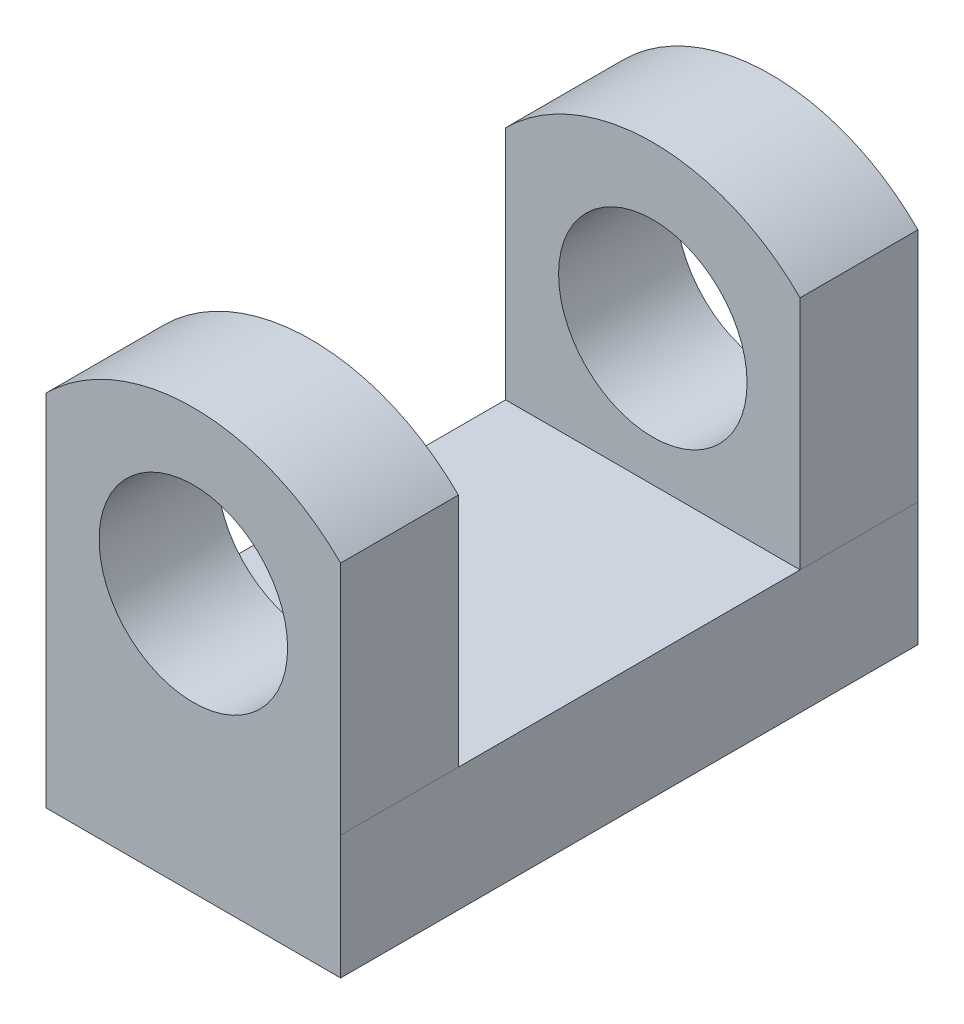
ISO-10303-21;
HEADER;
FILE_DESCRIPTION(('STEP AP214'),'2;1');
FILE_NAME('part.step','',(''),(''),'','','');
FILE_SCHEMA(('AUTOMOTIVE_DESIGN { 1 0 10303 214 1 1 1 1 }'));
ENDSEC;
DATA;
#1=APPLICATION_CONTEXT('core data for automotive mechanical design processes');
#2=APPLICATION_PROTOCOL_DEFINITION('international standard','automotive_design',2000,#1);
#3=PRODUCT_CONTEXT('',#1,'mechanical');
#4=PRODUCT('Part','Part','',(#3));
#5=PRODUCT_RELATED_PRODUCT_CATEGORY('part','',(#4));
#6=PRODUCT_DEFINITION_FORMATION('','',#4);
#7=PRODUCT_DEFINITION_CONTEXT('part definition',#1,'design');
#8=PRODUCT_DEFINITION('design','',#6,#7);
#9=PRODUCT_DEFINITION_SHAPE('','',#8);
#10=(LENGTH_UNIT() NAMED_UNIT(*) SI_UNIT(.MILLI.,.METRE.));
#11=(NAMED_UNIT(*) PLANE_ANGLE_UNIT() SI_UNIT($,.RADIAN.));
#12=(NAMED_UNIT(*) SI_UNIT($,.STERADIAN.) SOLID_ANGLE_UNIT());
#13=UNCERTAINTY_MEASURE_WITH_UNIT(LENGTH_MEASURE(1.E-05),#10,'distance_accuracy_value','');
#14=(GEOMETRIC_REPRESENTATION_CONTEXT(3) GLOBAL_UNCERTAINTY_ASSIGNED_CONTEXT((#13)) GLOBAL_UNIT_ASSIGNED_CONTEXT((#10,
#11,#12)) REPRESENTATION_CONTEXT('',''));
#15=CARTESIAN_POINT('',(0.,0.,0.));
#16=DIRECTION('',(0.,0.,1.));
#17=DIRECTION('',(1.,0.,0.));
#18=AXIS2_PLACEMENT_3D('',#15,#16,#17);
#19=CARTESIAN_POINT('',(0.,0.254000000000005,0.));
#20=DIRECTION('',(0.,1.,0.));
#21=DIRECTION('',(0.,0.,1.));
#22=AXIS2_PLACEMENT_3D('',#19,#20,#21);
#23=PLANE('',#22);
#24=DIRECTION('',(0.,0.,-1.));
#25=VECTOR('',#24,1.);
#26=CARTESIAN_POINT('',(6.35,0.254000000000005,-12.446));
#27=LINE('',#26,#25);
#28=CARTESIAN_POINT('',(6.35,0.254000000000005,7.36599999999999));
#29=VERTEX_POINT('',#28);
#30=CARTESIAN_POINT('',(6.35,0.254000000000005,-7.366));
#31=VERTEX_POINT('',#30);
#32=EDGE_CURVE('E395',#29,#31,#27,.T.);
#33=ORIENTED_EDGE('',*,*,#32,.T.);
#34=DIRECTION('',(-1.,0.,0.));
#35=VECTOR('',#34,1.);
#36=CARTESIAN_POINT('',(0.,0.254000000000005,-7.366));
#37=LINE('',#36,#35);
#38=CARTESIAN_POINT('',(-6.35,0.254000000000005,-7.366));
#39=VERTEX_POINT('',#38);
#40=EDGE_CURVE('E57',#31,#39,#37,.T.);
#41=ORIENTED_EDGE('',*,*,#40,.T.);
#42=DIRECTION('',(0.,0.,1.));
#43=VECTOR('',#42,1.);
#44=CARTESIAN_POINT('',(-6.35,0.254000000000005,-12.446));
#45=LINE('',#44,#43);
#46=CARTESIAN_POINT('',(-6.35,0.254000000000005,7.366));
#47=VERTEX_POINT('',#46);
#48=EDGE_CURVE('E459',#39,#47,#45,.T.);
#49=ORIENTED_EDGE('',*,*,#48,.T.);
#50=DIRECTION('',(-1.,0.,0.));
#51=VECTOR('',#50,1.);
#52=CARTESIAN_POINT('',(6.350012,0.254000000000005,7.36599999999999));
#53=LINE('',#52,#51);
#54=EDGE_CURVE('E184',#29,#47,#53,.T.);
#55=ORIENTED_EDGE('',*,*,#54,.F.);
#56=EDGE_LOOP('',(#33,#41,#49,#55));
#57=FACE_BOUND('',#56,.T.);
#58=ADVANCED_FACE('F45',(#57),#23,.T.);
#59=CARTESIAN_POINT('',(6.35,-5.08,-12.446));
#60=DIRECTION('',(1.,0.,0.));
#61=DIRECTION('',(0.,0.,-1.));
#62=AXIS2_PLACEMENT_3D('',#59,#60,#61);
#63=PLANE('',#62);
#64=DIRECTION('',(0.,1.,0.));
#65=VECTOR('',#64,1.);
#66=CARTESIAN_POINT('',(6.35,-5.08,-12.446));
#67=LINE('',#66,#65);
#68=CARTESIAN_POINT('',(6.35,-5.08,-12.446));
#69=VERTEX_POINT('',#68);
#70=CARTESIAN_POINT('',(6.35,0.254000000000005,-12.446));
#71=VERTEX_POINT('',#70);
#72=EDGE_CURVE('E374',#69,#71,#67,.T.);
#73=ORIENTED_EDGE('',*,*,#72,.T.);
#74=EDGE_CURVE('E189',#31,#71,#27,.T.);
#75=ORIENTED_EDGE('',*,*,#74,.F.);
#76=ORIENTED_EDGE('',*,*,#32,.F.);
#77=CARTESIAN_POINT('',(6.350012,0.254000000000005,12.446));
#78=DIRECTION('',(0.,0.,-1.));
#79=VECTOR('',#78,1.);
#80=LINE('',#77,#79);
#81=CARTESIAN_POINT('',(6.350006,0.254000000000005,12.446));
#82=VERTEX_POINT('',#81);
#83=EDGE_CURVE('E196',#82,#29,#80,.T.);
#84=ORIENTED_EDGE('',*,*,#83,.F.);
#85=DIRECTION('',(0.,1.,0.));
#86=VECTOR('',#85,1.);
#87=CARTESIAN_POINT('',(6.35,-5.08,12.446));
#88=LINE('',#87,#86);
#89=CARTESIAN_POINT('',(6.35,-5.08,12.446));
#90=VERTEX_POINT('',#89);
#91=EDGE_CURVE('E402',#90,#82,#88,.T.);
#92=ORIENTED_EDGE('',*,*,#91,.F.);
#93=DIRECTION('',(0.,0.,-1.));
#94=VECTOR('',#93,1.);
#95=CARTESIAN_POINT('',(6.35,-5.08,-12.446));
#96=LINE('',#95,#94);
#97=EDGE_CURVE('E378',#90,#69,#96,.T.);
#98=ORIENTED_EDGE('',*,*,#97,.T.);
#99=EDGE_LOOP('',(#73,#75,#76,#84,#92,#98));
#100=FACE_BOUND('',#99,.T.);
#101=ADVANCED_FACE('F47',(#100),#63,.T.);
#102=CARTESIAN_POINT('',(-6.35,-5.08,12.446));
#103=DIRECTION('',(0.,0.,1.));
#104=DIRECTION('',(1.,0.,0.));
#105=AXIS2_PLACEMENT_3D('',#102,#103,#104);
#106=PLANE('',#105);
#107=CARTESIAN_POINT('',(0.000130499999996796,4.06384449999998,12.446));
#108=DIRECTION('',(0.,0.,1.));
#109=DIRECTION('',(1.,0.,0.));
#110=AXIS2_PLACEMENT_3D('',#107,#108,#109);
#111=CIRCLE('',#110,8.98047603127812);
#112=CARTESIAN_POINT('',(-6.35,10.4140249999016,12.446));
#113=VERTEX_POINT('',#112);
#114=CARTESIAN_POINT('',(6.350012,10.4142739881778,12.446));
#115=VERTEX_POINT('',#114);
#116=EDGE_CURVE('E64',#113,#115,#111,.F.);
#117=ORIENTED_EDGE('',*,*,#116,.F.);
#118=DIRECTION('',(0.,1.,0.));
#119=VECTOR('',#118,1.);
#120=CARTESIAN_POINT('',(-6.35,-5.08,12.446));
#121=LINE('',#120,#119);
#122=CARTESIAN_POINT('',(-6.35,-5.08,12.446));
#123=VERTEX_POINT('',#122);
#124=EDGE_CURVE('E388',#123,#113,#121,.T.);
#125=ORIENTED_EDGE('',*,*,#124,.F.);
#126=DIRECTION('',(1.,0.,0.));
#127=VECTOR('',#126,1.);
#128=CARTESIAN_POINT('',(-6.35,-5.08,12.446));
#129=LINE('',#128,#127);
#130=EDGE_CURVE('E383',#123,#90,#129,.T.);
#131=ORIENTED_EDGE('',*,*,#130,.T.);
#132=ORIENTED_EDGE('',*,*,#91,.T.);
#133=DIRECTION('',(0.,-1.,0.));
#134=VECTOR('',#133,1.);
#135=CARTESIAN_POINT('',(6.350012,0.254000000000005,12.446));
#136=LINE('',#135,#134);
#137=EDGE_CURVE('E50',#115,#82,#136,.T.);
#138=ORIENTED_EDGE('',*,*,#137,.F.);
#139=EDGE_LOOP('',(#117,#125,#131,#132,#138));
#140=FACE_BOUND('',#139,.T.);
#141=CARTESIAN_POINT('',(0.,6.096,12.446));
#142=DIRECTION('',(0.,0.,1.));
#143=DIRECTION('',(1.,0.,0.));
#144=AXIS2_PLACEMENT_3D('',#141,#142,#143);
#145=CIRCLE('',#144,4.064);
#146=CARTESIAN_POINT('',(4.064,6.096,12.446));
#147=VERTEX_POINT('',#146);
#148=EDGE_CURVE('E427',#147,#147,#145,.T.);
#149=ORIENTED_EDGE('',*,*,#148,.F.);
#150=EDGE_LOOP('',(#149));
#151=FACE_BOUND('',#150,.T.);
#152=ADVANCED_FACE('F227',(#140,#151),#106,.T.);
#153=CARTESIAN_POINT('',(-6.35,-5.08,-12.446));
#154=DIRECTION('',(-1.,0.,0.));
#155=DIRECTION('',(0.,0.,1.));
#156=AXIS2_PLACEMENT_3D('',#153,#154,#155);
#157=PLANE('',#156);
#158=DIRECTION('',(0.,0.,-1.));
#159=VECTOR('',#158,1.);
#160=CARTESIAN_POINT('',(-6.35,10.4140249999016,12.44628));
#161=LINE('',#160,#159);
#162=CARTESIAN_POINT('',(-6.35,10.4140249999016,7.366));
#163=VERTEX_POINT('',#162);
#164=EDGE_CURVE('E433',#163,#113,#161,.F.);
#165=ORIENTED_EDGE('',*,*,#164,.F.);
#166=DIRECTION('',(0.,1.,0.));
#167=VECTOR('',#166,1.);
#168=CARTESIAN_POINT('',(-6.35,18.034,7.366));
#169=LINE('',#168,#167);
#170=EDGE_CURVE('E175',#47,#163,#169,.T.);
#171=ORIENTED_EDGE('',*,*,#170,.F.);
#172=ORIENTED_EDGE('',*,*,#48,.F.);
#173=CARTESIAN_POINT('',(-6.35,0.254000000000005,-12.446));
#174=VERTEX_POINT('',#173);
#175=EDGE_CURVE('E452',#174,#39,#45,.T.);
#176=ORIENTED_EDGE('',*,*,#175,.F.);
#177=DIRECTION('',(0.,1.,0.));
#178=VECTOR('',#177,1.);
#179=CARTESIAN_POINT('',(-6.35,-5.08,-12.446));
#180=LINE('',#179,#178);
#181=CARTESIAN_POINT('',(-6.35,-5.08,-12.446));
#182=VERTEX_POINT('',#181);
#183=EDGE_CURVE('E382',#182,#174,#180,.T.);
#184=ORIENTED_EDGE('',*,*,#183,.F.);
#185=DIRECTION('',(0.,0.,1.));
#186=VECTOR('',#185,1.);
#187=CARTESIAN_POINT('',(-6.35,-5.08,-12.446));
#188=LINE('',#187,#186);
#189=EDGE_CURVE('E391',#182,#123,#188,.T.);
#190=ORIENTED_EDGE('',*,*,#189,.T.);
#191=ORIENTED_EDGE('',*,*,#124,.T.);
#192=EDGE_LOOP('',(#165,#171,#172,#176,#184,#190,#191));
#193=FACE_BOUND('',#192,.T.);
#194=ADVANCED_FACE('F230',(#193),#157,.T.);
#195=CARTESIAN_POINT('',(-6.35,-5.08,-12.446));
#196=DIRECTION('',(0.,0.,-1.));
#197=DIRECTION('',(-1.,0.,0.));
#198=AXIS2_PLACEMENT_3D('',#195,#196,#197);
#199=PLANE('',#198);
#200=CARTESIAN_POINT('',(0.000130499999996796,4.06384449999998,-12.446));
#201=DIRECTION('',(0.,0.,1.));
#202=DIRECTION('',(1.,0.,0.));
#203=AXIS2_PLACEMENT_3D('',#200,#201,#202);
#204=CIRCLE('',#203,8.98047603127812);
#205=CARTESIAN_POINT('',(6.350286,10.414,-12.446));
#206=VERTEX_POINT('',#205);
#207=CARTESIAN_POINT('',(-6.350025,10.414,-12.446));
#208=VERTEX_POINT('',#207);
#209=EDGE_CURVE('E72',#206,#208,#204,.T.);
#210=ORIENTED_EDGE('',*,*,#209,.F.);
#211=DIRECTION('',(0.,1.,0.));
#212=VECTOR('',#211,1.);
#213=CARTESIAN_POINT('',(6.350286,0.254000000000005,-12.446));
#214=LINE('',#213,#212);
#215=CARTESIAN_POINT('',(6.350286,0.254000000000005,-12.446));
#216=VERTEX_POINT('',#215);
#217=EDGE_CURVE('E146',#216,#206,#214,.T.);
#218=ORIENTED_EDGE('',*,*,#217,.F.);
#219=DIRECTION('',(-1.,0.,0.));
#220=VECTOR('',#219,1.);
#221=CARTESIAN_POINT('',(6.350286,0.254000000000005,-12.446));
#222=LINE('',#221,#220);
#223=EDGE_CURVE('E172',#216,#71,#222,.T.);
#224=ORIENTED_EDGE('',*,*,#223,.T.);
#225=ORIENTED_EDGE('',*,*,#72,.F.);
#226=DIRECTION('',(-1.,0.,0.));
#227=VECTOR('',#226,1.);
#228=CARTESIAN_POINT('',(-6.35,-5.08,-12.446));
#229=LINE('',#228,#227);
#230=EDGE_CURVE('E463',#69,#182,#229,.T.);
#231=ORIENTED_EDGE('',*,*,#230,.T.);
#232=ORIENTED_EDGE('',*,*,#183,.T.);
#233=CARTESIAN_POINT('',(-6.350025,0.254000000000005,-12.446));
#234=VERTEX_POINT('',#233);
#235=EDGE_CURVE('E171',#174,#234,#222,.T.);
#236=ORIENTED_EDGE('',*,*,#235,.T.);
#237=DIRECTION('',(0.,1.,0.));
#238=VECTOR('',#237,1.);
#239=CARTESIAN_POINT('',(-6.350025,0.254000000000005,-12.446));
#240=LINE('',#239,#238);
#241=EDGE_CURVE('E149',#234,#208,#240,.T.);
#242=ORIENTED_EDGE('',*,*,#241,.T.);
#243=EDGE_LOOP('',(#210,#218,#224,#225,#231,#232,#236,#242));
#244=FACE_BOUND('',#243,.T.);
#245=CARTESIAN_POINT('',(0.,6.096,-12.446));
#246=DIRECTION('',(0.,0.,-1.));
#247=DIRECTION('',(-1.,0.,0.));
#248=AXIS2_PLACEMENT_3D('',#245,#246,#247);
#249=CIRCLE('',#248,4.064);
#250=CARTESIAN_POINT('',(-4.064,6.096,-12.446));
#251=VERTEX_POINT('',#250);
#252=EDGE_CURVE('E422',#251,#251,#249,.T.);
#253=ORIENTED_EDGE('',*,*,#252,.F.);
#254=EDGE_LOOP('',(#253));
#255=FACE_BOUND('',#254,.T.);
#256=ADVANCED_FACE('F143',(#244,#255),#199,.T.);
#257=CARTESIAN_POINT('',(0.,-5.08,0.));
#258=DIRECTION('',(0.,1.,0.));
#259=DIRECTION('',(0.,0.,1.));
#260=AXIS2_PLACEMENT_3D('',#257,#258,#259);
#261=PLANE('',#260);
#262=ORIENTED_EDGE('',*,*,#97,.F.);
#263=ORIENTED_EDGE('',*,*,#130,.F.);
#264=ORIENTED_EDGE('',*,*,#189,.F.);
#265=ORIENTED_EDGE('',*,*,#230,.F.);
#266=EDGE_LOOP('',(#262,#263,#264,#265));
#267=FACE_BOUND('',#266,.T.);
#268=ADVANCED_FACE('F219',(#267),#261,.F.);
#269=CARTESIAN_POINT('',(6.350012,18.034,7.366));
#270=DIRECTION('',(0.,0.,1.));
#271=DIRECTION('',(1.,0.,0.));
#272=AXIS2_PLACEMENT_3D('',#269,#270,#271);
#273=PLANE('',#272);
#274=CARTESIAN_POINT('',(0.,6.096,7.366));
#275=DIRECTION('',(0.,0.,1.));
#276=DIRECTION('',(1.,0.,0.));
#277=AXIS2_PLACEMENT_3D('',#274,#275,#276);
#278=CIRCLE('',#277,4.064);
#279=CARTESIAN_POINT('',(4.064,6.096,7.366));
#280=VERTEX_POINT('',#279);
#281=EDGE_CURVE('E421',#280,#280,#278,.T.);
#282=ORIENTED_EDGE('',*,*,#281,.T.);
#283=EDGE_LOOP('',(#282));
#284=FACE_BOUND('',#283,.T.);
#285=ORIENTED_EDGE('',*,*,#170,.T.);
#286=CARTESIAN_POINT('',(0.000130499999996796,4.06384449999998,7.366));
#287=DIRECTION('',(0.,0.,1.));
#288=DIRECTION('',(1.,0.,0.));
#289=AXIS2_PLACEMENT_3D('',#286,#287,#288);
#290=CIRCLE('',#289,8.98047603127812);
#291=CARTESIAN_POINT('',(6.350012,10.4142739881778,7.366));
#292=VERTEX_POINT('',#291);
#293=EDGE_CURVE('E481',#163,#292,#290,.F.);
#294=ORIENTED_EDGE('',*,*,#293,.T.);
#295=DIRECTION('',(0.,1.,0.));
#296=VECTOR('',#295,1.);
#297=CARTESIAN_POINT('',(6.350012,18.034,7.366));
#298=LINE('',#297,#296);
#299=EDGE_CURVE('E179',#29,#292,#298,.T.);
#300=ORIENTED_EDGE('',*,*,#299,.F.);
#301=ORIENTED_EDGE('',*,*,#54,.T.);
#302=EDGE_LOOP('',(#285,#294,#300,#301));
#303=FACE_BOUND('',#302,.T.);
#304=ADVANCED_FACE('F214',(#284,#303),#273,.F.);
#305=CARTESIAN_POINT('',(6.350012,0.,0.));
#306=DIRECTION('',(-1.,0.,0.));
#307=DIRECTION('',(0.,0.,1.));
#308=AXIS2_PLACEMENT_3D('',#305,#306,#307);
#309=PLANE('',#308);
#310=ORIENTED_EDGE('',*,*,#299,.T.);
#311=DIRECTION('',(0.,0.,-1.));
#312=VECTOR('',#311,1.);
#313=CARTESIAN_POINT('',(6.350012,10.4142739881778,12.44628));
#314=LINE('',#313,#312);
#315=EDGE_CURVE('E477',#292,#115,#314,.F.);
#316=ORIENTED_EDGE('',*,*,#315,.T.);
#317=ORIENTED_EDGE('',*,*,#137,.T.);
#318=ORIENTED_EDGE('',*,*,#83,.T.);
#319=EDGE_LOOP('',(#310,#316,#317,#318));
#320=FACE_BOUND('',#319,.T.);
#321=ADVANCED_FACE('F203',(#320),#309,.F.);
#322=CARTESIAN_POINT('',(6.350286,0.254000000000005,-7.366));
#323=DIRECTION('',(0.,1.,0.));
#324=DIRECTION('',(0.,0.,1.));
#325=AXIS2_PLACEMENT_3D('',#322,#323,#324);
#326=PLANE('',#325);
#327=ORIENTED_EDGE('',*,*,#74,.T.);
#328=ORIENTED_EDGE('',*,*,#223,.F.);
#329=DIRECTION('',(0.,0.,-1.));
#330=VECTOR('',#329,1.);
#331=CARTESIAN_POINT('',(6.350286,0.254000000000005,-7.366));
#332=LINE('',#331,#330);
#333=CARTESIAN_POINT('',(6.350286,0.254000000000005,-7.366));
#334=VERTEX_POINT('',#333);
#335=EDGE_CURVE('E154',#334,#216,#332,.T.);
#336=ORIENTED_EDGE('',*,*,#335,.F.);
#337=DIRECTION('',(-1.,0.,0.));
#338=VECTOR('',#337,1.);
#339=CARTESIAN_POINT('',(6.350286,0.254000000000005,-7.366));
#340=LINE('',#339,#338);
#341=EDGE_CURVE('E167',#334,#31,#340,.T.);
#342=ORIENTED_EDGE('',*,*,#341,.T.);
#343=EDGE_LOOP('',(#327,#328,#336,#342));
#344=FACE_BOUND('',#343,.T.);
#345=ADVANCED_FACE('F213',(#344),#326,.F.);
#346=ORIENTED_EDGE('',*,*,#175,.T.);
#347=CARTESIAN_POINT('',(-6.350025,0.254000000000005,-7.366));
#348=VERTEX_POINT('',#347);
#349=EDGE_CURVE('E161',#39,#348,#340,.T.);
#350=ORIENTED_EDGE('',*,*,#349,.T.);
#351=DIRECTION('',(0.,0.,-1.));
#352=VECTOR('',#351,1.);
#353=CARTESIAN_POINT('',(-6.350025,0.254000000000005,-7.366));
#354=LINE('',#353,#352);
#355=EDGE_CURVE('E440',#348,#234,#354,.T.);
#356=ORIENTED_EDGE('',*,*,#355,.T.);
#357=ORIENTED_EDGE('',*,*,#235,.F.);
#358=EDGE_LOOP('',(#346,#350,#356,#357));
#359=FACE_BOUND('',#358,.T.);
#360=ADVANCED_FACE('F215',(#359),#326,.F.);
#361=CARTESIAN_POINT('',(6.350286,18.034,-7.366));
#362=DIRECTION('',(0.,0.,-1.));
#363=DIRECTION('',(0.,1.,0.));
#364=AXIS2_PLACEMENT_3D('',#361,#362,#363);
#365=PLANE('',#364);
#366=CARTESIAN_POINT('',(0.,6.096,-7.366));
#367=DIRECTION('',(0.,0.,-1.));
#368=DIRECTION('',(0.,1.,0.));
#369=AXIS2_PLACEMENT_3D('',#366,#367,#368);
#370=CIRCLE('',#369,4.064);
#371=CARTESIAN_POINT('',(0.,10.16,-7.366));
#372=VERTEX_POINT('',#371);
#373=EDGE_CURVE('E418',#372,#372,#370,.T.);
#374=ORIENTED_EDGE('',*,*,#373,.T.);
#375=EDGE_LOOP('',(#374));
#376=FACE_BOUND('',#375,.T.);
#377=DIRECTION('',(0.,-1.,0.));
#378=VECTOR('',#377,1.);
#379=CARTESIAN_POINT('',(6.350286,18.034,-7.366));
#380=LINE('',#379,#378);
#381=CARTESIAN_POINT('',(6.350286,10.414,-7.366));
#382=VERTEX_POINT('',#381);
#383=EDGE_CURVE('E157',#382,#334,#380,.T.);
#384=ORIENTED_EDGE('',*,*,#383,.F.);
#385=CARTESIAN_POINT('',(0.000130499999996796,4.06384449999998,-7.366));
#386=DIRECTION('',(0.,0.,-1.));
#387=DIRECTION('',(0.,1.,0.));
#388=AXIS2_PLACEMENT_3D('',#385,#386,#387);
#389=CIRCLE('',#388,8.98047603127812);
#390=CARTESIAN_POINT('',(-6.35002500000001,10.414,-7.366));
#391=VERTEX_POINT('',#390);
#392=EDGE_CURVE('E135',#382,#391,#389,.F.);
#393=ORIENTED_EDGE('',*,*,#392,.T.);
#394=DIRECTION('',(0.,-1.,0.));
#395=VECTOR('',#394,1.);
#396=CARTESIAN_POINT('',(-6.350025,18.034,-7.366));
#397=LINE('',#396,#395);
#398=EDGE_CURVE('E163',#391,#348,#397,.T.);
#399=ORIENTED_EDGE('',*,*,#398,.T.);
#400=ORIENTED_EDGE('',*,*,#349,.F.);
#401=ORIENTED_EDGE('',*,*,#40,.F.);
#402=ORIENTED_EDGE('',*,*,#341,.F.);
#403=EDGE_LOOP('',(#384,#393,#399,#400,#401,#402));
#404=FACE_BOUND('',#403,.T.);
#405=ADVANCED_FACE('F255',(#376,#404),#365,.F.);
#406=CARTESIAN_POINT('',(6.350286,0.,0.));
#407=DIRECTION('',(1.,0.,0.));
#408=DIRECTION('',(0.,0.,-1.));
#409=AXIS2_PLACEMENT_3D('',#406,#407,#408);
#410=PLANE('',#409);
#411=DIRECTION('',(0.,0.,-1.));
#412=VECTOR('',#411,1.);
#413=CARTESIAN_POINT('',(6.350286,10.414,12.44628));
#414=LINE('',#413,#412);
#415=EDGE_CURVE('E132',#382,#206,#414,.T.);
#416=ORIENTED_EDGE('',*,*,#415,.F.);
#417=ORIENTED_EDGE('',*,*,#383,.T.);
#418=ORIENTED_EDGE('',*,*,#335,.T.);
#419=ORIENTED_EDGE('',*,*,#217,.T.);
#420=EDGE_LOOP('',(#416,#417,#418,#419));
#421=FACE_BOUND('',#420,.T.);
#422=ADVANCED_FACE('F152',(#421),#410,.T.);
#423=CARTESIAN_POINT('',(-6.350025,0.,0.));
#424=DIRECTION('',(1.,0.,0.));
#425=DIRECTION('',(0.,0.,-1.));
#426=AXIS2_PLACEMENT_3D('',#423,#424,#425);
#427=PLANE('',#426);
#428=ORIENTED_EDGE('',*,*,#398,.F.);
#429=DIRECTION('',(0.,0.,-1.));
#430=VECTOR('',#429,1.);
#431=CARTESIAN_POINT('',(-6.350025,10.414,12.44628));
#432=LINE('',#431,#430);
#433=EDGE_CURVE('E11',#391,#208,#432,.T.);
#434=ORIENTED_EDGE('',*,*,#433,.T.);
#435=ORIENTED_EDGE('',*,*,#241,.F.);
#436=ORIENTED_EDGE('',*,*,#355,.F.);
#437=EDGE_LOOP('',(#428,#434,#435,#436));
#438=FACE_BOUND('',#437,.T.);
#439=ADVANCED_FACE('F267',(#438),#427,.F.);
#440=CARTESIAN_POINT('',(0.,6.096,12.44628));
#441=DIRECTION('',(0.,0.,-1.));
#442=DIRECTION('',(-1.,0.,0.));
#443=AXIS2_PLACEMENT_3D('',#440,#441,#442);
#444=CYLINDRICAL_SURFACE('',#443,4.064);
#445=ORIENTED_EDGE('',*,*,#252,.T.);
#446=EDGE_LOOP('',(#445));
#447=FACE_BOUND('',#446,.T.);
#448=ORIENTED_EDGE('',*,*,#373,.F.);
#449=EDGE_LOOP('',(#448));
#450=FACE_BOUND('',#449,.T.);
#451=ADVANCED_FACE('F275',(#447,#450),#444,.F.);
#452=ORIENTED_EDGE('',*,*,#148,.T.);
#453=EDGE_LOOP('',(#452));
#454=FACE_BOUND('',#453,.T.);
#455=ORIENTED_EDGE('',*,*,#281,.F.);
#456=EDGE_LOOP('',(#455));
#457=FACE_BOUND('',#456,.T.);
#458=ADVANCED_FACE('F286',(#454,#457),#444,.F.);
#459=CARTESIAN_POINT('',(0.000130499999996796,4.06384449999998,12.44628));
#460=DIRECTION('',(0.,0.,-1.));
#461=DIRECTION('',(-1.,0.,0.));
#462=AXIS2_PLACEMENT_3D('',#459,#460,#461);
#463=CYLINDRICAL_SURFACE('',#462,8.98047603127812);
#464=ORIENTED_EDGE('',*,*,#415,.T.);
#465=ORIENTED_EDGE('',*,*,#209,.T.);
#466=ORIENTED_EDGE('',*,*,#433,.F.);
#467=ORIENTED_EDGE('',*,*,#392,.F.);
#468=EDGE_LOOP('',(#464,#465,#466,#467));
#469=FACE_BOUND('',#468,.T.);
#470=ADVANCED_FACE('F133',(#469),#463,.T.);
#471=ORIENTED_EDGE('',*,*,#116,.T.);
#472=ORIENTED_EDGE('',*,*,#315,.F.);
#473=ORIENTED_EDGE('',*,*,#293,.F.);
#474=ORIENTED_EDGE('',*,*,#164,.T.);
#475=EDGE_LOOP('',(#471,#472,#473,#474));
#476=FACE_BOUND('',#475,.T.);
#477=ADVANCED_FACE('F285',(#476),#463,.T.);
#478=CLOSED_SHELL('',(#58,#101,#152,#194,#256,#268,#304,#321,#345,#360,#405,#422,#439,#451,#458,
#470,#477));
#479=MANIFOLD_SOLID_BREP('B2',#478);
#480=ADVANCED_BREP_SHAPE_REPRESENTATION('',(#18,#479),#14);
#481=SHAPE_DEFINITION_REPRESENTATION(#9,#480);
ENDSEC;
END-ISO-10303-21;
